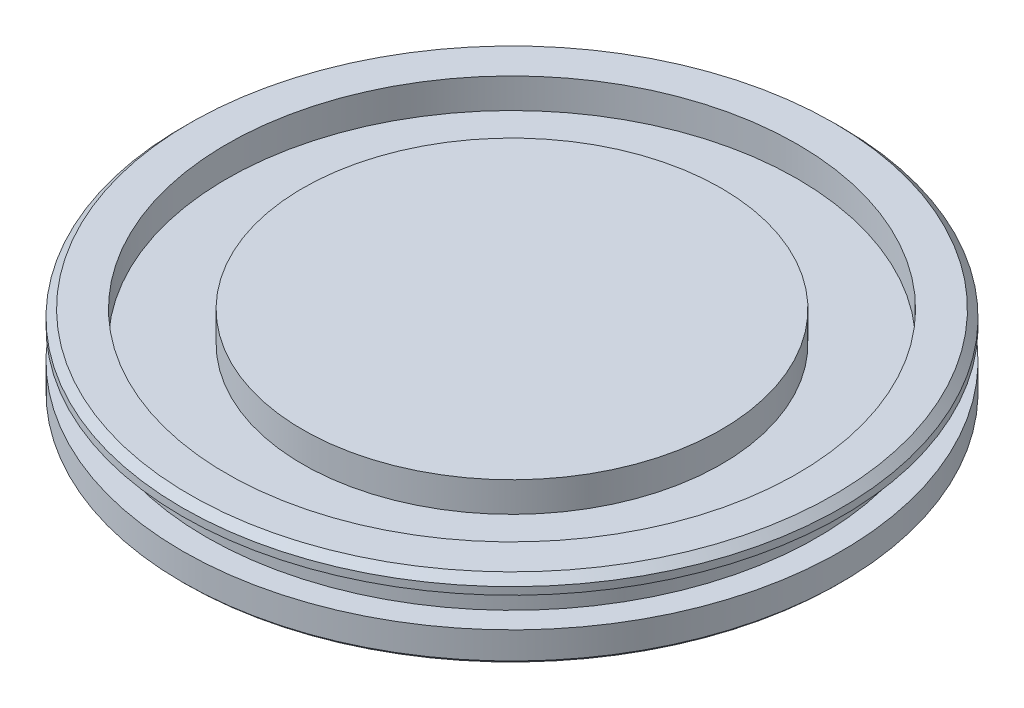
from build123d import *

# Parameters (mm, degrees)
CHAMFER1_SIZE = 0.25
CHAMFER2_SIZE = 0.1


with BuildPart() as part:
    # Sketch1 → Revolve1 (revolve)
    with BuildSketch(Plane.XY, mode=Mode.PRIVATE) as revolve1_sk:
        Polygon((0, 0), (-6.985, 0), (-6.985, -1), (-9.525, -1), (-9.525, 0), (-11, 0), (-11, -0.5), (-10.2, -0.5), (-10.2, -1.5), (-11, -1.5), (-11, -2.5), (0, -2.5), align=None)
    revolve(revolve1_sk.sketch.rotate(Axis((0, 0, 0), (0, 1, 0)), 270), axis=Axis((0, 0, 0), (0, 1, 0)))

    # Chamfer1
    chamfer1_edges = [part.edges().sort_by_distance(p)[0] for p in [
        (0, 0, 11),
    ]]
    chamfer(chamfer1_edges, length=CHAMFER1_SIZE)

    # Chamfer2
    chamfer2_edges = [part.edges().sort_by_distance(p)[0] for p in [
        (0, -2.5, 11),
    ]]
    chamfer(chamfer2_edges, length=CHAMFER2_SIZE)


solid = part.part
